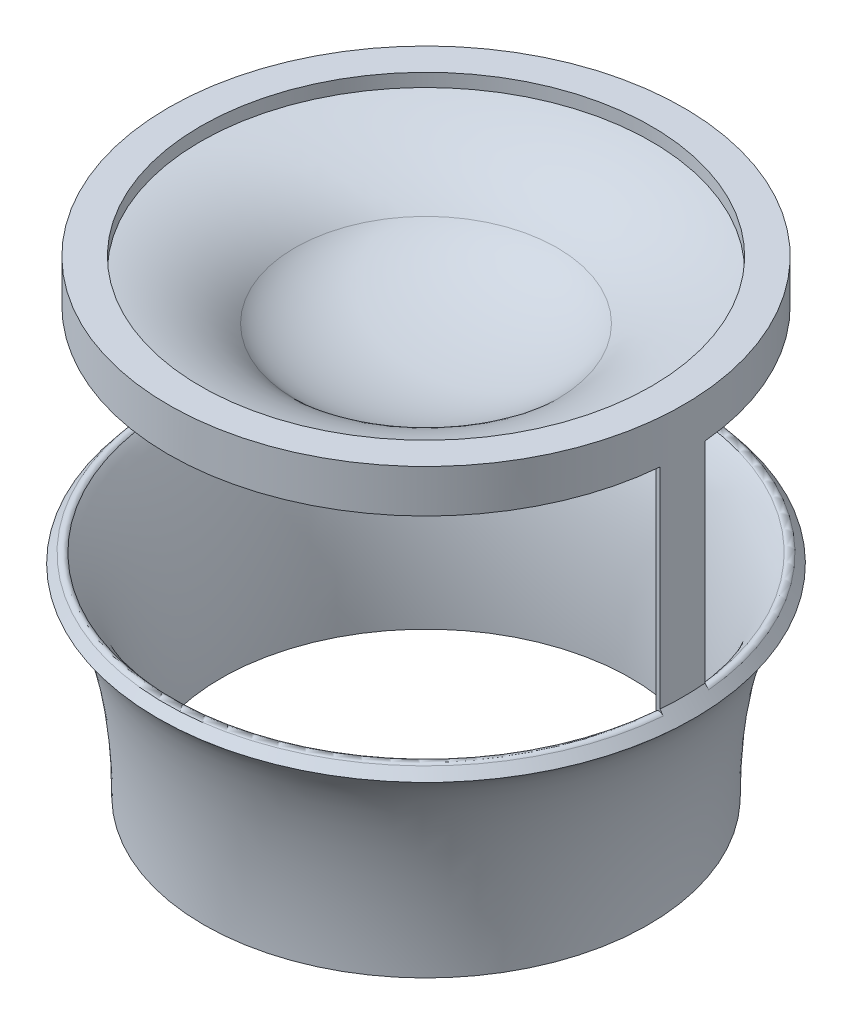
ISO-10303-21;
HEADER;
FILE_DESCRIPTION(('STEP AP214'),'2;1');
FILE_NAME('part.step','',(''),(''),'','','');
FILE_SCHEMA(('AUTOMOTIVE_DESIGN { 1 0 10303 214 1 1 1 1 }'));
ENDSEC;
DATA;
#1=APPLICATION_CONTEXT('core data for automotive mechanical design processes');
#2=APPLICATION_PROTOCOL_DEFINITION('international standard','automotive_design',2000,#1);
#3=PRODUCT_CONTEXT('',#1,'mechanical');
#4=PRODUCT('Part','Part','',(#3));
#5=PRODUCT_RELATED_PRODUCT_CATEGORY('part','',(#4));
#6=PRODUCT_DEFINITION_FORMATION('','',#4);
#7=PRODUCT_DEFINITION_CONTEXT('part definition',#1,'design');
#8=PRODUCT_DEFINITION('design','',#6,#7);
#9=PRODUCT_DEFINITION_SHAPE('','',#8);
#10=(LENGTH_UNIT() NAMED_UNIT(*) SI_UNIT(.MILLI.,.METRE.));
#11=(NAMED_UNIT(*) PLANE_ANGLE_UNIT() SI_UNIT($,.RADIAN.));
#12=(NAMED_UNIT(*) SI_UNIT($,.STERADIAN.) SOLID_ANGLE_UNIT());
#13=UNCERTAINTY_MEASURE_WITH_UNIT(LENGTH_MEASURE(1.E-05),#10,'distance_accuracy_value','');
#14=(GEOMETRIC_REPRESENTATION_CONTEXT(3) GLOBAL_UNCERTAINTY_ASSIGNED_CONTEXT((#13)) GLOBAL_UNIT_ASSIGNED_CONTEXT((#10,
#11,#12)) REPRESENTATION_CONTEXT('',''));
#15=CARTESIAN_POINT('',(0.,0.,0.));
#16=DIRECTION('',(0.,0.,1.));
#17=DIRECTION('',(1.,0.,0.));
#18=AXIS2_PLACEMENT_3D('',#15,#16,#17);
#19=CARTESIAN_POINT('',(0.,100.,0.));
#20=DIRECTION('',(0.,1.,0.));
#21=DIRECTION('',(-1.,0.,0.));
#22=AXIS2_PLACEMENT_3D('',#19,#20,#21);
#23=CYLINDRICAL_SURFACE('',#22,600.);
#24=CARTESIAN_POINT('',(0.,100.,0.));
#25=DIRECTION('',(0.,1.,0.));
#26=DIRECTION('',(-1.,0.,0.));
#27=AXIS2_PLACEMENT_3D('',#24,#25,#26);
#28=CIRCLE('',#27,600.);
#29=CARTESIAN_POINT('',(-600.,100.,0.));
#30=VERTEX_POINT('',#29);
#31=EDGE_CURVE('E170',#30,#30,#28,.T.);
#32=ORIENTED_EDGE('',*,*,#31,.F.);
#33=EDGE_LOOP('',(#32));
#34=FACE_BOUND('',#33,.T.);
#35=CARTESIAN_POINT('',(0.,-488.620764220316,0.));
#36=DIRECTION('',(0.,1.,0.));
#37=DIRECTION('',(0.,0.,1.));
#38=AXIS2_PLACEMENT_3D('',#35,#36,#37);
#39=CIRCLE('',#38,600.);
#40=CARTESIAN_POINT('',(597.716818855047,-488.620764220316,52.293445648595));
#41=VERTEX_POINT('',#40);
#42=CARTESIAN_POINT('',(597.716818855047,-488.620764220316,-52.2934456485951));
#43=VERTEX_POINT('',#42);
#44=EDGE_CURVE('E91',#41,#43,#39,.T.);
#45=ORIENTED_EDGE('',*,*,#44,.T.);
#46=DIRECTION('',(0.,1.,0.));
#47=VECTOR('',#46,1.);
#48=CARTESIAN_POINT('',(597.716818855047,0.,-52.293445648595));
#49=LINE('',#48,#47);
#50=CARTESIAN_POINT('',(597.716818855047,0.,-52.293445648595));
#51=VERTEX_POINT('',#50);
#52=EDGE_CURVE('E102',#43,#51,#49,.T.);
#53=ORIENTED_EDGE('',*,*,#52,.T.);
#54=CARTESIAN_POINT('',(0.,0.,0.));
#55=DIRECTION('',(0.,1.,0.));
#56=DIRECTION('',(-1.,0.,0.));
#57=AXIS2_PLACEMENT_3D('',#54,#55,#56);
#58=CIRCLE('',#57,600.);
#59=CARTESIAN_POINT('',(597.716818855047,0.,52.293445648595));
#60=VERTEX_POINT('',#59);
#61=EDGE_CURVE('E173',#51,#60,#58,.T.);
#62=ORIENTED_EDGE('',*,*,#61,.T.);
#63=DIRECTION('',(0.,1.,0.));
#64=VECTOR('',#63,1.);
#65=CARTESIAN_POINT('',(597.716818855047,0.,52.293445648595));
#66=LINE('',#65,#64);
#67=EDGE_CURVE('E104',#41,#60,#66,.T.);
#68=ORIENTED_EDGE('',*,*,#67,.F.);
#69=EDGE_LOOP('',(#45,#53,#62,#68));
#70=FACE_BOUND('',#69,.T.);
#71=ADVANCED_FACE('F33',(#34,#70),#23,.T.);
#72=CARTESIAN_POINT('',(0.,161.537817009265,0.));
#73=DIRECTION('',(0.,1.,0.));
#74=DIRECTION('',(0.,0.,1.));
#75=AXIS2_PLACEMENT_3D('',#72,#73,#74);
#76=CYLINDRICAL_SURFACE('',#75,590.);
#77=CARTESIAN_POINT('',(0.,-497.677142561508,0.));
#78=DIRECTION('',(0.,1.,0.));
#79=DIRECTION('',(0.,0.,1.));
#80=AXIS2_PLACEMENT_3D('',#77,#78,#79);
#81=CIRCLE('',#80,590.);
#82=CARTESIAN_POINT('',(587.75487187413,-497.677142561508,51.4218882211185));
#83=VERTEX_POINT('',#82);
#84=CARTESIAN_POINT('',(587.75487187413,-497.677142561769,-51.4218882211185));
#85=VERTEX_POINT('',#84);
#86=EDGE_CURVE('E105',#83,#85,#81,.T.);
#87=ORIENTED_EDGE('',*,*,#86,.F.);
#88=DIRECTION('',(0.,-1.,0.));
#89=VECTOR('',#88,1.);
#90=CARTESIAN_POINT('',(587.75487187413,0.,51.4218882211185));
#91=LINE('',#90,#89);
#92=CARTESIAN_POINT('',(587.75487187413,-0.118410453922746,51.4218882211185));
#93=VERTEX_POINT('',#92);
#94=EDGE_CURVE('E124',#93,#83,#91,.T.);
#95=ORIENTED_EDGE('',*,*,#94,.F.);
#96=CARTESIAN_POINT('',(0.,-0.118410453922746,0.));
#97=DIRECTION('',(0.,1.,0.));
#98=DIRECTION('',(-1.,0.,0.));
#99=AXIS2_PLACEMENT_3D('',#96,#97,#98);
#100=CIRCLE('',#99,590.);
#101=CARTESIAN_POINT('',(587.75487187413,-0.118410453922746,-51.4218882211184));
#102=VERTEX_POINT('',#101);
#103=EDGE_CURVE('E176',#93,#102,#100,.T.);
#104=ORIENTED_EDGE('',*,*,#103,.T.);
#105=DIRECTION('',(0.,-1.,0.));
#106=VECTOR('',#105,1.);
#107=CARTESIAN_POINT('',(587.75487187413,0.,-51.4218882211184));
#108=LINE('',#107,#106);
#109=EDGE_CURVE('E113',#102,#85,#108,.T.);
#110=ORIENTED_EDGE('',*,*,#109,.T.);
#111=EDGE_LOOP('',(#87,#95,#104,#110));
#112=FACE_BOUND('',#111,.T.);
#113=ADVANCED_FACE('F198',(#112),#76,.F.);
#114=CARTESIAN_POINT('',(597.716818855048,-500.,52.293445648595));
#115=DIRECTION('',(0.0871557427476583,0.,-0.996194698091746));
#116=DIRECTION('',(-0.996194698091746,0.,-0.0871557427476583));
#117=AXIS2_PLACEMENT_3D('',#114,#115,#116);
#118=PLANE('',#117);
#119=CARTESIAN_POINT('',(597.716818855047,-488.620764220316,52.293445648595));
#120=CARTESIAN_POINT('',(596.46776286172,-489.62917607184,52.1841674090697));
#121=CARTESIAN_POINT('',(594.027368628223,-491.690914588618,51.9706605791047));
#122=CARTESIAN_POINT('',(589.220502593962,-496.108841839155,51.5501142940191));
#123=CARTESIAN_POINT('',(583.410283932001,-502.114551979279,51.0417860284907));
#124=CARTESIAN_POINT('',(576.702669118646,-510.08423033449,50.4549457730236));
#125=CARTESIAN_POINT('',(568.085781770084,-521.696835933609,49.7010658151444));
#126=CARTESIAN_POINT('',(557.870944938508,-538.030715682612,48.8073833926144));
#127=CARTESIAN_POINT('',(546.40770751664,-560.450969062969,47.8044800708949));
#128=CARTESIAN_POINT('',(535.70717250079,-585.594050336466,46.8683045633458));
#129=CARTESIAN_POINT('',(522.462782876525,-622.582289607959,45.7095706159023));
#130=CARTESIAN_POINT('',(507.883907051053,-674.949357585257,44.4340842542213));
#131=CARTESIAN_POINT('',(493.846053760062,-746.108601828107,43.2059312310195));
#132=CARTESIAN_POINT('',(485.284368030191,-810.824179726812,42.4568807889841));
#133=CARTESIAN_POINT('',(480.437152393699,-864.822367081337,42.0328043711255));
#134=CARTESIAN_POINT('',(477.823991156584,-906.165065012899,41.8041823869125));
#135=CARTESIAN_POINT('',(476.249572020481,-948.061910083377,41.6664385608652));
#136=CARTESIAN_POINT('',(475.898962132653,-976.209390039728,41.6357641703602));
#137=CARTESIAN_POINT('',(475.898962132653,-990.257748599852,41.6357641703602));
#138=B_SPLINE_CURVE_WITH_KNOTS('',3,(#119,#120,#121,#122,#123,#124,#125,#126,#127,#128,#129,
#130,#131,#132,#133,#134,#135,#136,#137),.UNSPECIFIED.,.F.,.F.,(4,1,1,1,1,1,1,1,1,1,1,1,1,1,1,1,
4),(-2.90483763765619,-2.88399324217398,-2.86314884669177,-2.82146005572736,-2.77977126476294,
-2.73808247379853,-2.6547048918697,-2.57132730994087,-2.48794972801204,-2.4045721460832,
-2.23781698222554,-2.07106181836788,-1.90430665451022,-1.82092907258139,-1.73755149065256,
-1.65417390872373,-1.5707963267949),.UNSPECIFIED.);
#139=CARTESIAN_POINT('',(587.843268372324,-497.5875945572,51.4296219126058));
#140=VERTEX_POINT('',#139);
#141=EDGE_CURVE('E114',#140,#83,#138,.T.);
#142=ORIENTED_EDGE('',*,*,#141,.F.);
#143=CARTESIAN_POINT('',(596.330764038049,-506.038098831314,52.1721815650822));
#144=DIRECTION('',(0.0871557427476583,0.,-0.996194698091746));
#145=DIRECTION('',(-0.996194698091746,0.,-0.0871557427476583));
#146=AXIS2_PLACEMENT_3D('',#143,#144,#145);
#147=CIRCLE('',#146,12.);
#148=CARTESIAN_POINT('',(605.646111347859,-498.517453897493,52.9871688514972));
#149=VERTEX_POINT('',#148);
#150=EDGE_CURVE('E41',#140,#149,#147,.T.);
#151=ORIENTED_EDGE('',*,*,#150,.T.);
#152=DIRECTION('',(0.624335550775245,-0.779244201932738,0.054622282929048));
#153=VECTOR('',#152,1.);
#154=CARTESIAN_POINT('',(0.,257.400129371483,0.));
#155=LINE('',#154,#153);
#156=EDGE_CURVE('E48',#41,#149,#155,.T.);
#157=ORIENTED_EDGE('',*,*,#156,.F.);
#158=ORIENTED_EDGE('',*,*,#67,.T.);
#159=CARTESIAN_POINT('',(597.716818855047,-200.,52.293445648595));
#160=DIRECTION('',(0.0871557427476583,0.,-0.996194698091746));
#161=DIRECTION('',(-0.996194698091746,0.,-0.0871557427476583));
#162=AXIS2_PLACEMENT_3D('',#159,#160,#161);
#163=ELLIPSE('',#162,290.649290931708,200.);
#164=EDGE_CURVE('E178',#60,#93,#163,.F.);
#165=ORIENTED_EDGE('',*,*,#164,.T.);
#166=ORIENTED_EDGE('',*,*,#94,.T.);
#167=EDGE_LOOP('',(#142,#151,#157,#158,#165,#166));
#168=FACE_BOUND('',#167,.T.);
#169=ADVANCED_FACE('F203',(#168),#118,.F.);
#170=CARTESIAN_POINT('',(597.716818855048,-500.,-52.293445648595));
#171=DIRECTION('',(-0.0871557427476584,0.,-0.996194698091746));
#172=DIRECTION('',(-0.996194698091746,0.,0.0871557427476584));
#173=AXIS2_PLACEMENT_3D('',#170,#171,#172);
#174=PLANE('',#173);
#175=ORIENTED_EDGE('',*,*,#52,.F.);
#176=DIRECTION('',(0.624335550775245,-0.779244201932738,-0.054622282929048));
#177=VECTOR('',#176,1.);
#178=CARTESIAN_POINT('',(0.,257.400129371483,0.));
#179=LINE('',#178,#177);
#180=CARTESIAN_POINT('',(605.646111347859,-498.517453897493,-52.9871688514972));
#181=VERTEX_POINT('',#180);
#182=EDGE_CURVE('E87',#181,#43,#179,.F.);
#183=ORIENTED_EDGE('',*,*,#182,.F.);
#184=CARTESIAN_POINT('',(596.330764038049,-506.038098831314,-52.1721815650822));
#185=DIRECTION('',(-0.0871557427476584,0.,-0.996194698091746));
#186=DIRECTION('',(-0.996194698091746,0.,0.0871557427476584));
#187=AXIS2_PLACEMENT_3D('',#184,#185,#186);
#188=CIRCLE('',#187,12.);
#189=CARTESIAN_POINT('',(587.843268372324,-497.5875945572,-51.4296219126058));
#190=VERTEX_POINT('',#189);
#191=EDGE_CURVE('E11',#181,#190,#188,.F.);
#192=ORIENTED_EDGE('',*,*,#191,.T.);
#193=CARTESIAN_POINT('',(597.716818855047,-488.620764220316,-52.2934456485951));
#194=CARTESIAN_POINT('',(596.46776286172,-489.62917607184,-52.1841674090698));
#195=CARTESIAN_POINT('',(594.027368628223,-491.690914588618,-51.9706605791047));
#196=CARTESIAN_POINT('',(589.220502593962,-496.108841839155,-51.5501142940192));
#197=CARTESIAN_POINT('',(583.410283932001,-502.114551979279,-51.0417860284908));
#198=CARTESIAN_POINT('',(576.702669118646,-510.08423033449,-50.4549457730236));
#199=CARTESIAN_POINT('',(568.085781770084,-521.696835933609,-49.7010658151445));
#200=CARTESIAN_POINT('',(557.870944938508,-538.030715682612,-48.8073833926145));
#201=CARTESIAN_POINT('',(546.40770751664,-560.450969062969,-47.8044800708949));
#202=CARTESIAN_POINT('',(535.70717250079,-585.594050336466,-46.8683045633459));
#203=CARTESIAN_POINT('',(522.462782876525,-622.582289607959,-45.7095706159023));
#204=CARTESIAN_POINT('',(507.883907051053,-674.949357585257,-44.4340842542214));
#205=CARTESIAN_POINT('',(493.846053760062,-746.108601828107,-43.2059312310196));
#206=CARTESIAN_POINT('',(485.284368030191,-810.824179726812,-42.4568807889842));
#207=CARTESIAN_POINT('',(480.437152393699,-864.822367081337,-42.0328043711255));
#208=CARTESIAN_POINT('',(477.823991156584,-906.165065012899,-41.8041823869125));
#209=CARTESIAN_POINT('',(476.249572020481,-948.061910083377,-41.6664385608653));
#210=CARTESIAN_POINT('',(475.898962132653,-976.209390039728,-41.6357641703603));
#211=CARTESIAN_POINT('',(475.898962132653,-990.257748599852,-41.6357641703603));
#212=B_SPLINE_CURVE_WITH_KNOTS('',3,(#193,#194,#195,#196,#197,#198,#199,#200,#201,#202,#203,
#204,#205,#206,#207,#208,#209,#210,#211),.UNSPECIFIED.,.F.,.F.,(4,1,1,1,1,1,1,1,1,1,1,1,1,1,1,1,
4),(-2.90483763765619,-2.88399324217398,-2.86314884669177,-2.82146005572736,-2.77977126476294,
-2.73808247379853,-2.6547048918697,-2.57132730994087,-2.48794972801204,-2.4045721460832,
-2.23781698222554,-2.07106181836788,-1.90430665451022,-1.82092907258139,-1.73755149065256,
-1.65417390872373,-1.5707963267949),.UNSPECIFIED.);
#213=EDGE_CURVE('E180',#190,#85,#212,.T.);
#214=ORIENTED_EDGE('',*,*,#213,.T.);
#215=ORIENTED_EDGE('',*,*,#109,.F.);
#216=CARTESIAN_POINT('',(597.716818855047,-200.,-52.2934456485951));
#217=DIRECTION('',(-0.0871557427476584,0.,-0.996194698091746));
#218=DIRECTION('',(-0.996194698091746,0.,0.0871557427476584));
#219=AXIS2_PLACEMENT_3D('',#216,#217,#218);
#220=ELLIPSE('',#219,290.649290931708,200.);
#221=EDGE_CURVE('E111',#51,#102,#220,.F.);
#222=ORIENTED_EDGE('',*,*,#221,.F.);
#223=EDGE_LOOP('',(#175,#183,#192,#214,#215,#222));
#224=FACE_BOUND('',#223,.T.);
#225=ADVANCED_FACE('F108',(#224),#174,.T.);
#226=CARTESIAN_POINT('',(600.,-200.,0.));
#227=DIRECTION('',(0.,0.,-1.));
#228=DIRECTION('',(-1.,0.,0.));
#229=AXIS2_PLACEMENT_3D('',#226,#227,#228);
#230=ELLIPSE('',#229,290.649290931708,200.);
#231=CARTESIAN_POINT('',(0.,100.,0.));
#232=DIRECTION('',(0.,1.,0.));
#233=AXIS1_PLACEMENT('',#231,#232);
#234=SURFACE_OF_REVOLUTION('',#230,#233);
#235=CARTESIAN_POINT('',(0.,-88.0876328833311,0.));
#236=DIRECTION('',(0.,1.,0.));
#237=DIRECTION('',(-1.,0.,0.));
#238=AXIS2_PLACEMENT_3D('',#235,#236,#237);
#239=CIRCLE('',#238,359.113179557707);
#240=CARTESIAN_POINT('',(-359.113179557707,-88.0876328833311,0.));
#241=VERTEX_POINT('',#240);
#242=EDGE_CURVE('E131',#241,#241,#239,.T.);
#243=ORIENTED_EDGE('',*,*,#242,.T.);
#244=EDGE_LOOP('',(#243));
#245=FACE_BOUND('',#244,.T.);
#246=ORIENTED_EDGE('',*,*,#164,.F.);
#247=ORIENTED_EDGE('',*,*,#61,.F.);
#248=ORIENTED_EDGE('',*,*,#221,.T.);
#249=ORIENTED_EDGE('',*,*,#103,.F.);
#250=EDGE_LOOP('',(#246,#247,#248,#249));
#251=FACE_BOUND('',#250,.T.);
#252=ADVANCED_FACE('F202',(#245,#251),#234,.T.);
#253=CARTESIAN_POINT('',(600.,100.,0.));
#254=DIRECTION('',(0.,-1.,0.));
#255=DIRECTION('',(1.,0.,0.));
#256=AXIS2_PLACEMENT_3D('',#253,#254,#255);
#257=PLANE('',#256);
#258=ORIENTED_EDGE('',*,*,#31,.T.);
#259=EDGE_LOOP('',(#258));
#260=FACE_BOUND('',#259,.T.);
#261=CARTESIAN_POINT('',(0.,100.,0.));
#262=DIRECTION('',(0.,-1.,0.));
#263=DIRECTION('',(1.,0.,0.));
#264=AXIS2_PLACEMENT_3D('',#261,#262,#263);
#265=CIRCLE('',#264,525.);
#266=CARTESIAN_POINT('',(525.,100.,0.));
#267=VERTEX_POINT('',#266);
#268=EDGE_CURVE('E132',#267,#267,#265,.F.);
#269=ORIENTED_EDGE('',*,*,#268,.F.);
#270=EDGE_LOOP('',(#269));
#271=FACE_BOUND('',#270,.T.);
#272=ADVANCED_FACE('F162',(#260,#271),#257,.F.);
#273=CARTESIAN_POINT('',(0.,0.,0.));
#274=DIRECTION('',(0.,0.,1.));
#275=DIRECTION('',(1.,0.,0.));
#276=AXIS2_PLACEMENT_3D('',#273,#274,#275);
#277=ELLIPSE('',#276,400.,200.);
#278=TRIMMED_CURVE('',#277,(PARAMETER_VALUE(4.71238898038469)),
(PARAMETER_VALUE(7.85398163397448)),.T.,.PARAMETER.);
#279=CARTESIAN_POINT('',(0.,100.,0.));
#280=DIRECTION('',(0.,1.,0.));
#281=AXIS1_PLACEMENT('',#279,#280);
#282=SURFACE_OF_REVOLUTION('',#278,#281);
#283=ORIENTED_EDGE('',*,*,#242,.F.);
#284=EDGE_LOOP('',(#283));
#285=FACE_BOUND('',#284,.T.);
#286=CARTESIAN_POINT('',(0.,-200.,0.));
#287=VERTEX_POINT('',#286);
#288=VERTEX_LOOP('',#287);
#289=FACE_BOUND('',#288,.T.);
#290=ADVANCED_FACE('F158',(#285,#289),#282,.T.);
#291=CARTESIAN_POINT('',(600.,-200.,0.));
#292=DIRECTION('',(0.,0.,-1.));
#293=DIRECTION('',(-1.,0.,0.));
#294=AXIS2_PLACEMENT_3D('',#291,#292,#293);
#295=ELLIPSE('',#294,290.649290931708,200.);
#296=CARTESIAN_POINT('',(0.,100.,0.));
#297=DIRECTION('',(0.,1.,0.));
#298=AXIS1_PLACEMENT('',#296,#297);
#299=SURFACE_OF_REVOLUTION('',#295,#298);
#300=OFFSET_SURFACE('',#299,-75.,.F.);
#301=CARTESIAN_POINT('',(0.,69.2815750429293,0.));
#302=DIRECTION('',(0.,1.,0.));
#303=DIRECTION('',(-1.,0.,0.));
#304=AXIS2_PLACEMENT_3D('',#301,#302,#303);
#305=CIRCLE('',#304,525.);
#306=CARTESIAN_POINT('',(-525.,69.2815750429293,0.));
#307=VERTEX_POINT('',#306);
#308=EDGE_CURVE('E128',#307,#307,#305,.T.);
#309=ORIENTED_EDGE('',*,*,#308,.T.);
#310=EDGE_LOOP('',(#309));
#311=FACE_BOUND('',#310,.T.);
#312=CARTESIAN_POINT('',(0.,-35.5610896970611,0.));
#313=DIRECTION('',(0.,1.,0.));
#314=DIRECTION('',(1.,0.,0.));
#315=AXIS2_PLACEMENT_3D('',#312,#313,#314);
#316=CIRCLE('',#315,305.57849677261);
#317=CARTESIAN_POINT('',(305.57849677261,-35.5610896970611,0.));
#318=VERTEX_POINT('',#317);
#319=EDGE_CURVE('E127',#318,#318,#316,.T.);
#320=ORIENTED_EDGE('',*,*,#319,.F.);
#321=EDGE_LOOP('',(#320));
#322=FACE_BOUND('',#321,.T.);
#323=ADVANCED_FACE('F145',(#311,#322),#300,.F.);
#324=CARTESIAN_POINT('',(0.,100.,0.));
#325=DIRECTION('',(0.,1.,0.));
#326=DIRECTION('',(-1.,0.,0.));
#327=AXIS2_PLACEMENT_3D('',#324,#325,#326);
#328=CYLINDRICAL_SURFACE('',#327,525.);
#329=ORIENTED_EDGE('',*,*,#268,.T.);
#330=EDGE_LOOP('',(#329));
#331=FACE_BOUND('',#330,.T.);
#332=ORIENTED_EDGE('',*,*,#308,.F.);
#333=EDGE_LOOP('',(#332));
#334=FACE_BOUND('',#333,.T.);
#335=ADVANCED_FACE('F147',(#331,#334),#328,.F.);
#336=CARTESIAN_POINT('',(0.,0.,0.));
#337=DIRECTION('',(0.,0.,1.));
#338=DIRECTION('',(1.,0.,0.));
#339=AXIS2_PLACEMENT_3D('',#336,#337,#338);
#340=ELLIPSE('',#339,400.,200.);
#341=TRIMMED_CURVE('',#340,(PARAMETER_VALUE(4.71238898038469)),
(PARAMETER_VALUE(7.85398163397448)),.T.,.PARAMETER.);
#342=CARTESIAN_POINT('',(0.,100.,0.));
#343=DIRECTION('',(0.,1.,0.));
#344=AXIS1_PLACEMENT('',#342,#343);
#345=SURFACE_OF_REVOLUTION('',#341,#344);
#346=OFFSET_SURFACE('',#345,-75.,.F.);
#347=ORIENTED_EDGE('',*,*,#319,.T.);
#348=EDGE_LOOP('',(#347));
#349=FACE_BOUND('',#348,.T.);
#350=CARTESIAN_POINT('',(0.,-125.,0.));
#351=VERTEX_POINT('',#350);
#352=VERTEX_LOOP('',#351);
#353=FACE_BOUND('',#352,.T.);
#354=ADVANCED_FACE('F150',(#349,#353),#346,.F.);
#355=CARTESIAN_POINT('',(600.,-488.620764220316,0.));
#356=CARTESIAN_POINT('',(598.746172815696,-489.62917607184,0.));
#357=CARTESIAN_POINT('',(596.296456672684,-491.690914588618,0.));
#358=CARTESIAN_POINT('',(591.471229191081,-496.108841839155,0.));
#359=CARTESIAN_POINT('',(585.63881643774,-502.114551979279,0.));
#360=CARTESIAN_POINT('',(578.905579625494,-510.08423033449,0.));
#361=CARTESIAN_POINT('',(570.255777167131,-521.696835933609,0.));
#362=CARTESIAN_POINT('',(560.001921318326,-538.030715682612,0.));
#363=CARTESIAN_POINT('',(548.494896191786,-560.450969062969,0.));
#364=CARTESIAN_POINT('',(537.753486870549,-585.594050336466,0.));
#365=CARTESIAN_POINT('',(524.458505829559,-622.582289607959,0.));
#366=CARTESIAN_POINT('',(509.823941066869,-674.949357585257,0.));
#367=CARTESIAN_POINT('',(495.732465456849,-746.108601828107,0.));
#368=CARTESIAN_POINT('',(487.138075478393,-810.824179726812,0.));
#369=CARTESIAN_POINT('',(482.272344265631,-864.822367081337,0.));
#370=CARTESIAN_POINT('',(479.649201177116,-906.165065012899,0.));
#371=CARTESIAN_POINT('',(478.068768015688,-948.061910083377,0.));
#372=CARTESIAN_POINT('',(477.716818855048,-976.209390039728,0.));
#373=CARTESIAN_POINT('',(477.716818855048,-990.257748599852,0.));
#374=B_SPLINE_CURVE_WITH_KNOTS('',3,(#355,#356,#357,#358,#359,#360,#361,#362,#363,#364,#365,
#366,#367,#368,#369,#370,#371,#372,#373),.UNSPECIFIED.,.F.,.F.,(4,1,1,1,1,1,1,1,1,1,1,1,1,1,1,1,
4),(-2.90483763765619,-2.88399324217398,-2.86314884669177,-2.82146005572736,-2.77977126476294,
-2.73808247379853,-2.6547048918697,-2.57132730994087,-2.48794972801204,-2.4045721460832,
-2.23781698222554,-2.07106181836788,-1.90430665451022,-1.82092907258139,-1.73755149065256,
-1.65417390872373,-1.5707963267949),.UNSPECIFIED.);
#375=CARTESIAN_POINT('',(0.,185.506164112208,0.));
#376=DIRECTION('',(0.,1.,0.));
#377=AXIS1_PLACEMENT('',#375,#376);
#378=SURFACE_OF_REVOLUTION('',#374,#377);
#379=CARTESIAN_POINT('',(0.,-990.257748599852,0.));
#380=DIRECTION('',(0.,1.,0.));
#381=DIRECTION('',(0.,0.,1.));
#382=AXIS2_PLACEMENT_3D('',#379,#380,#381);
#383=CIRCLE('',#382,477.716818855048);
#384=CARTESIAN_POINT('',(0.,-990.257748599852,477.716818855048));
#385=VERTEX_POINT('',#384);
#386=EDGE_CURVE('E345',#385,#385,#383,.T.);
#387=ORIENTED_EDGE('',*,*,#386,.F.);
#388=EDGE_LOOP('',(#387));
#389=FACE_BOUND('',#388,.T.);
#390=ORIENTED_EDGE('',*,*,#213,.F.);
#391=CARTESIAN_POINT('',(0.,-497.5875945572,0.));
#392=DIRECTION('',(0.,1.,0.));
#393=DIRECTION('',(0.,0.,1.));
#394=AXIS2_PLACEMENT_3D('',#391,#392,#393);
#395=CIRCLE('',#394,590.088734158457);
#396=EDGE_CURVE('E98',#190,#140,#395,.T.);
#397=ORIENTED_EDGE('',*,*,#396,.T.);
#398=ORIENTED_EDGE('',*,*,#141,.T.);
#399=ORIENTED_EDGE('',*,*,#86,.T.);
#400=EDGE_LOOP('',(#390,#397,#398,#399));
#401=FACE_BOUND('',#400,.T.);
#402=ADVANCED_FACE('F154',(#389,#401),#378,.T.);
#403=CARTESIAN_POINT('',(0.,-519.790532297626,0.));
#404=DIRECTION('',(0.,-1.,0.));
#405=DIRECTION('',(0.,0.,-1.));
#406=AXIS2_PLACEMENT_3D('',#403,#404,#405);
#407=CONICAL_SURFACE('',#406,625.06881644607,0.677337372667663);
#408=ORIENTED_EDGE('',*,*,#44,.F.);
#409=ORIENTED_EDGE('',*,*,#156,.T.);
#410=CARTESIAN_POINT('',(0.,-498.517453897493,0.));
#411=DIRECTION('',(0.,1.,0.));
#412=DIRECTION('',(0.,0.,1.));
#413=AXIS2_PLACEMENT_3D('',#410,#411,#412);
#414=CIRCLE('',#413,607.959581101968);
#415=EDGE_CURVE('E94',#149,#181,#414,.F.);
#416=ORIENTED_EDGE('',*,*,#415,.T.);
#417=ORIENTED_EDGE('',*,*,#182,.T.);
#418=EDGE_LOOP('',(#408,#409,#416,#417));
#419=FACE_BOUND('',#418,.T.);
#420=CARTESIAN_POINT('',(0.,-519.790532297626,0.));
#421=DIRECTION('',(0.,1.,0.));
#422=DIRECTION('',(0.,0.,1.));
#423=AXIS2_PLACEMENT_3D('',#420,#421,#422);
#424=CIRCLE('',#423,625.06881644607);
#425=CARTESIAN_POINT('',(0.,-519.790532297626,625.06881644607));
#426=VERTEX_POINT('',#425);
#427=EDGE_CURVE('E106',#426,#426,#424,.T.);
#428=ORIENTED_EDGE('',*,*,#427,.T.);
#429=EDGE_LOOP('',(#428));
#430=FACE_BOUND('',#429,.T.);
#431=ADVANCED_FACE('F89',(#419,#430),#407,.T.);
#432=CARTESIAN_POINT('',(517.716818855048,-990.257748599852,0.));
#433=CARTESIAN_POINT('',(517.716818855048,-976.543596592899,0.));
#434=CARTESIAN_POINT('',(518.060461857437,-949.062112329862,0.));
#435=CARTESIAN_POINT('',(519.60287926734,-908.178292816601,0.));
#436=CARTESIAN_POINT('',(522.160546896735,-867.872744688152,0.));
#437=CARTESIAN_POINT('',(526.897564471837,-815.309078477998,0.));
#438=CARTESIAN_POINT('',(535.241295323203,-752.519817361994,0.));
#439=CARTESIAN_POINT('',(546.553033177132,-695.45717619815,0.));
#440=CARTESIAN_POINT('',(557.148886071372,-654.268278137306,0.));
#441=CARTESIAN_POINT('',(565.792365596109,-625.84682623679,0.));
#442=CARTESIAN_POINT('',(575.043917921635,-600.127431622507,0.));
#443=CARTESIAN_POINT('',(584.794270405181,-577.330798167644,0.));
#444=CARTESIAN_POINT('',(593.220772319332,-560.944442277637,0.));
#445=CARTESIAN_POINT('',(600.050279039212,-549.498540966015,0.));
#446=CARTESIAN_POINT('',(605.186758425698,-541.766970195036,0.));
#447=CARTESIAN_POINT('',(610.303540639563,-534.906840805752,0.));
#448=CARTESIAN_POINT('',(614.517788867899,-529.927500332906,0.));
#449=CARTESIAN_POINT('',(617.835724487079,-526.38945715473,0.));
#450=CARTESIAN_POINT('',(620.291998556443,-523.957366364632,0.));
#451=CARTESIAN_POINT('',(622.303445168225,-522.116691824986,0.));
#452=CARTESIAN_POINT('',(623.895197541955,-520.748797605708,0.));
#453=CARTESIAN_POINT('',(624.672499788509,-520.109276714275,0.));
#454=CARTESIAN_POINT('',(625.06881644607,-519.790532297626,0.));
#455=B_SPLINE_CURVE_WITH_KNOTS('',3,(#432,#433,#434,#435,#436,#437,#438,#439,#440,#441,#442,
#443,#444,#445,#446,#447,#448,#449,#450,#451,#452,#453,#454),.UNSPECIFIED.,.F.,.F.,(4,1,1,1,1,1,
1,1,1,1,1,1,1,1,1,1,1,1,1,1,4),(-2.90483763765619,-2.82146005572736,-2.73808247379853,
-2.6547048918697,-2.57132730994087,-2.4045721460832,-2.23781698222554,-2.15443940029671,
-2.07106181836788,-1.98768423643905,-1.90430665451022,-1.82092907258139,-1.77924028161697,
-1.73755149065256,-1.69586269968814,-1.65417390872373,-1.63332951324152,-1.61248511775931,
-1.5916407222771,-1.581218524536,-1.5707963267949),.UNSPECIFIED.);
#456=CARTESIAN_POINT('',(0.,185.506164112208,0.));
#457=DIRECTION('',(0.,1.,0.));
#458=AXIS1_PLACEMENT('',#456,#457);
#459=SURFACE_OF_REVOLUTION('',#455,#458);
#460=ORIENTED_EDGE('',*,*,#427,.F.);
#461=EDGE_LOOP('',(#460));
#462=FACE_BOUND('',#461,.T.);
#463=CARTESIAN_POINT('',(0.,-990.257748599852,0.));
#464=DIRECTION('',(0.,1.,0.));
#465=DIRECTION('',(0.,0.,1.));
#466=AXIS2_PLACEMENT_3D('',#463,#464,#465);
#467=CIRCLE('',#466,517.716818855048);
#468=CARTESIAN_POINT('',(0.,-990.257748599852,517.716818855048));
#469=VERTEX_POINT('',#468);
#470=EDGE_CURVE('E351',#469,#469,#467,.T.);
#471=ORIENTED_EDGE('',*,*,#470,.T.);
#472=EDGE_LOOP('',(#471));
#473=FACE_BOUND('',#472,.T.);
#474=ADVANCED_FACE('F261',(#462,#473),#459,.T.);
#475=CARTESIAN_POINT('',(477.716818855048,-990.257748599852,0.));
#476=DIRECTION('',(0.,1.,0.));
#477=DIRECTION('',(0.,0.,1.));
#478=AXIS2_PLACEMENT_3D('',#475,#476,#477);
#479=PLANE('',#478);
#480=ORIENTED_EDGE('',*,*,#470,.F.);
#481=EDGE_LOOP('',(#480));
#482=FACE_BOUND('',#481,.T.);
#483=ORIENTED_EDGE('',*,*,#386,.T.);
#484=EDGE_LOOP('',(#483));
#485=FACE_BOUND('',#484,.T.);
#486=ADVANCED_FACE('F269',(#482,#485),#479,.F.);
#487=CARTESIAN_POINT('',(0.,-506.038098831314,0.));
#488=DIRECTION('',(0.,-1.,0.));
#489=DIRECTION('',(0.,0.,-1.));
#490=AXIS2_PLACEMENT_3D('',#487,#488,#489);
#491=TOROIDAL_SURFACE('',#490,598.608650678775,12.);
#492=ORIENTED_EDGE('',*,*,#191,.F.);
#493=ORIENTED_EDGE('',*,*,#415,.F.);
#494=ORIENTED_EDGE('',*,*,#150,.F.);
#495=ORIENTED_EDGE('',*,*,#396,.F.);
#496=EDGE_LOOP('',(#492,#493,#494,#495));
#497=FACE_BOUND('',#496,.T.);
#498=ADVANCED_FACE('F35',(#497),#491,.T.);
#499=CLOSED_SHELL('',(#71,#113,#169,#225,#252,#272,#290,#323,#335,#354,#402,#431,#474,#486,#498));
#500=MANIFOLD_SOLID_BREP('B2',#499);
#501=ADVANCED_BREP_SHAPE_REPRESENTATION('',(#18,#500),#14);
#502=SHAPE_DEFINITION_REPRESENTATION(#9,#501);
ENDSEC;
END-ISO-10303-21;
